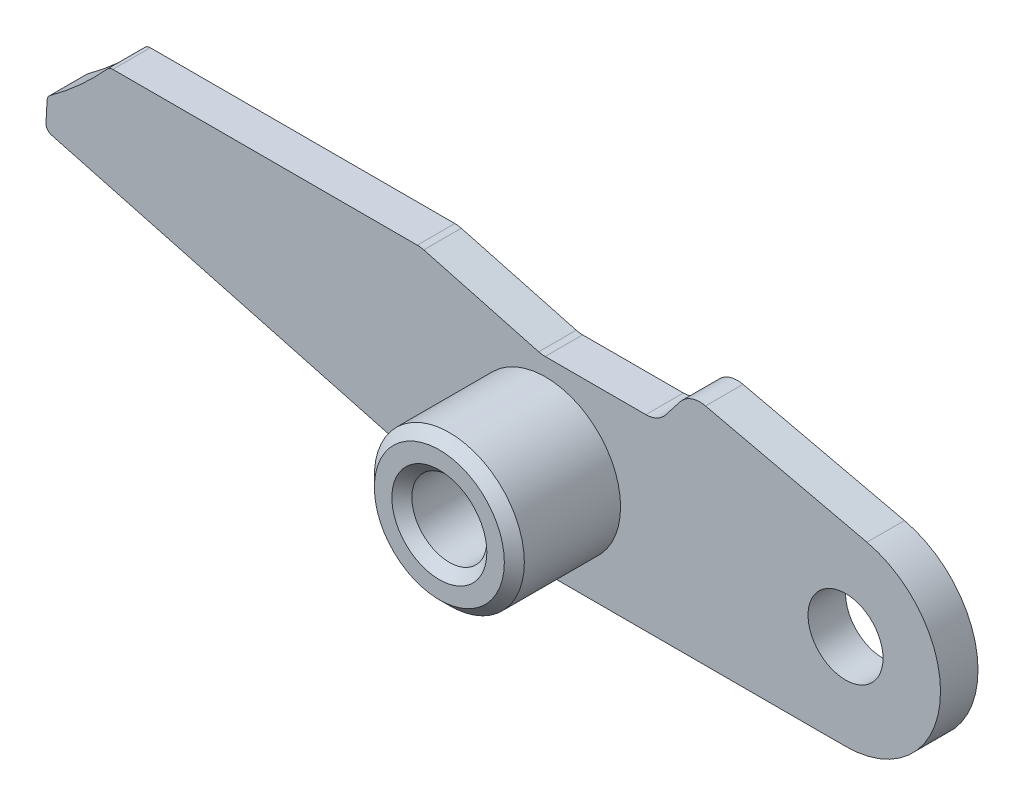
ISO-10303-21;
HEADER;
FILE_DESCRIPTION(('STEP AP214'),'2;1');
FILE_NAME('part.step','',(''),(''),'','','');
FILE_SCHEMA(('AUTOMOTIVE_DESIGN { 1 0 10303 214 1 1 1 1 }'));
ENDSEC;
DATA;
#1=APPLICATION_CONTEXT('core data for automotive mechanical design processes');
#2=APPLICATION_PROTOCOL_DEFINITION('international standard','automotive_design',2000,#1);
#3=PRODUCT_CONTEXT('',#1,'mechanical');
#4=PRODUCT('Part','Part','',(#3));
#5=PRODUCT_RELATED_PRODUCT_CATEGORY('part','',(#4));
#6=PRODUCT_DEFINITION_FORMATION('','',#4);
#7=PRODUCT_DEFINITION_CONTEXT('part definition',#1,'design');
#8=PRODUCT_DEFINITION('design','',#6,#7);
#9=PRODUCT_DEFINITION_SHAPE('','',#8);
#10=(LENGTH_UNIT() NAMED_UNIT(*) SI_UNIT(.MILLI.,.METRE.));
#11=(NAMED_UNIT(*) PLANE_ANGLE_UNIT() SI_UNIT($,.RADIAN.));
#12=(NAMED_UNIT(*) SI_UNIT($,.STERADIAN.) SOLID_ANGLE_UNIT());
#13=UNCERTAINTY_MEASURE_WITH_UNIT(LENGTH_MEASURE(1.E-05),#10,'distance_accuracy_value','');
#14=(GEOMETRIC_REPRESENTATION_CONTEXT(3) GLOBAL_UNCERTAINTY_ASSIGNED_CONTEXT((#13)) GLOBAL_UNIT_ASSIGNED_CONTEXT((#10,
#11,#12)) REPRESENTATION_CONTEXT('',''));
#15=CARTESIAN_POINT('',(0.,0.,0.));
#16=DIRECTION('',(0.,0.,1.));
#17=DIRECTION('',(1.,0.,0.));
#18=AXIS2_PLACEMENT_3D('',#15,#16,#17);
#19=CARTESIAN_POINT('',(-28.6659581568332,14.956057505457,-0.75));
#20=DIRECTION('',(0.,0.,1.));
#21=DIRECTION('',(1.,0.,0.));
#22=AXIS2_PLACEMENT_3D('',#19,#20,#21);
#23=PLANE('',#22);
#24=CARTESIAN_POINT('',(12.,0.,-0.75));
#25=DIRECTION('',(0.,0.,1.));
#26=DIRECTION('',(1.,0.,0.));
#27=AXIS2_PLACEMENT_3D('',#24,#25,#26);
#28=CIRCLE('',#27,1.5);
#29=CARTESIAN_POINT('',(13.5,0.,-0.75));
#30=VERTEX_POINT('',#29);
#31=EDGE_CURVE('E440',#30,#30,#28,.T.);
#32=ORIENTED_EDGE('',*,*,#31,.T.);
#33=EDGE_LOOP('',(#32));
#34=FACE_BOUND('',#33,.T.);
#35=DIRECTION('',(1.,0.,0.));
#36=VECTOR('',#35,1.);
#37=CARTESIAN_POINT('',(12.,-3.8,-0.75));
#38=LINE('',#37,#36);
#39=CARTESIAN_POINT('',(0.131652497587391,-3.8,-0.75));
#40=VERTEX_POINT('',#39);
#41=CARTESIAN_POINT('',(12.,-3.8,-0.75));
#42=VERTEX_POINT('',#41);
#43=EDGE_CURVE('E145',#40,#42,#38,.T.);
#44=ORIENTED_EDGE('',*,*,#43,.F.);
#45=CARTESIAN_POINT('',(0.131652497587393,-2.8,-0.75));
#46=DIRECTION('',(0.,0.,1.));
#47=DIRECTION('',(1.,0.,0.));
#48=AXIS2_PLACEMENT_3D('',#45,#46,#47);
#49=CIRCLE('',#48,1.);
#50=CARTESIAN_POINT('',(-0.127166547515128,-3.76592582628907,-0.75));
#51=VERTEX_POINT('',#50);
#52=EDGE_CURVE('E249',#40,#51,#49,.F.);
#53=ORIENTED_EDGE('',*,*,#52,.T.);
#54=DIRECTION('',(0.965925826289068,-0.258819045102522,0.));
#55=VECTOR('',#54,1.);
#56=CARTESIAN_POINT('',(0.,-3.8,-0.75));
#57=LINE('',#56,#55);
#58=CARTESIAN_POINT('',(-19.7653426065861,1.49610758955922,-0.75));
#59=VERTEX_POINT('',#58);
#60=EDGE_CURVE('E156',#59,#51,#57,.T.);
#61=ORIENTED_EDGE('',*,*,#60,.F.);
#62=CARTESIAN_POINT('',(-19.6876968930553,1.78588533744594,-0.75));
#63=DIRECTION('',(0.,0.,1.));
#64=DIRECTION('',(1.,0.,0.));
#65=AXIS2_PLACEMENT_3D('',#62,#63,#64);
#66=CIRCLE('',#65,0.3);
#67=CARTESIAN_POINT('',(-19.9872857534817,1.80158612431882,-0.75));
#68=VERTEX_POINT('',#67);
#69=EDGE_CURVE('E223',#59,#68,#66,.F.);
#70=ORIENTED_EDGE('',*,*,#69,.T.);
#71=DIRECTION('',(-0.0523359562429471,-0.998629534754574,0.));
#72=VECTOR('',#71,1.);
#73=CARTESIAN_POINT('',(-20.,1.55898384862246,-0.75));
#74=LINE('',#73,#72);
#75=CARTESIAN_POINT('',(-19.9447095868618,2.61398777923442,-0.75));
#76=VERTEX_POINT('',#75);
#77=EDGE_CURVE('E187',#76,#68,#74,.T.);
#78=ORIENTED_EDGE('',*,*,#77,.F.);
#79=CARTESIAN_POINT('',(-19.6451207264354,2.59828699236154,-0.75));
#80=DIRECTION('',(0.,0.,1.));
#81=DIRECTION('',(1.,0.,0.));
#82=AXIS2_PLACEMENT_3D('',#79,#80,#81);
#83=CIRCLE('',#82,0.3);
#84=CARTESIAN_POINT('',(-19.8219998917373,2.84059621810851,-0.75));
#85=VERTEX_POINT('',#84);
#86=EDGE_CURVE('E221',#76,#85,#83,.F.);
#87=ORIENTED_EDGE('',*,*,#86,.T.);
#88=CARTESIAN_POINT('',(-28.6659581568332,14.956057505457,-0.75));
#89=DIRECTION('',(0.,0.,-1.));
#90=DIRECTION('',(1.,0.,0.));
#91=AXIS2_PLACEMENT_3D('',#88,#89,#90);
#92=CIRCLE('',#91,15.);
#93=CARTESIAN_POINT('',(-17.5350187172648,4.90109916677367,-0.75));
#94=VERTEX_POINT('',#93);
#95=EDGE_CURVE('E184',#94,#85,#92,.T.);
#96=ORIENTED_EDGE('',*,*,#95,.F.);
#97=CARTESIAN_POINT('',(-17.3123999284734,4.7,-0.75));
#98=DIRECTION('',(0.,0.,1.));
#99=DIRECTION('',(1.,0.,0.));
#100=AXIS2_PLACEMENT_3D('',#97,#98,#99);
#101=CIRCLE('',#100,0.3);
#102=CARTESIAN_POINT('',(-17.3123999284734,5.,-0.75));
#103=VERTEX_POINT('',#102);
#104=EDGE_CURVE('E218',#94,#103,#101,.F.);
#105=ORIENTED_EDGE('',*,*,#104,.T.);
#106=DIRECTION('',(-1.,0.,0.));
#107=VECTOR('',#106,1.);
#108=CARTESIAN_POINT('',(-17.4464698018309,5.,-0.75));
#109=LINE('',#108,#107);
#110=CARTESIAN_POINT('',(-5.1316524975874,5.,-0.75));
#111=VERTEX_POINT('',#110);
#112=EDGE_CURVE('E182',#111,#103,#109,.T.);
#113=ORIENTED_EDGE('',*,*,#112,.F.);
#114=CARTESIAN_POINT('',(-5.1316524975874,4.,-0.75));
#115=DIRECTION('',(0.,0.,1.));
#116=DIRECTION('',(1.,0.,0.));
#117=AXIS2_PLACEMENT_3D('',#114,#115,#116);
#118=CIRCLE('',#117,1.);
#119=CARTESIAN_POINT('',(-4.87283345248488,4.96592582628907,-0.75));
#120=VERTEX_POINT('',#119);
#121=EDGE_CURVE('E245',#111,#120,#118,.F.);
#122=ORIENTED_EDGE('',*,*,#121,.T.);
#123=DIRECTION('',(-0.965925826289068,0.258819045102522,0.));
#124=VECTOR('',#123,1.);
#125=CARTESIAN_POINT('',(-5.,5.,-0.75));
#126=LINE('',#125,#124);
#127=CARTESIAN_POINT('',(-0.275500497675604,3.73407417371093,-0.75));
#128=VERTEX_POINT('',#127);
#129=EDGE_CURVE('E180',#128,#120,#126,.T.);
#130=ORIENTED_EDGE('',*,*,#129,.F.);
#131=CARTESIAN_POINT('',(-0.0166814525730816,4.7,-0.75));
#132=DIRECTION('',(0.,0.,1.));
#133=DIRECTION('',(1.,0.,0.));
#134=AXIS2_PLACEMENT_3D('',#131,#132,#133);
#135=CIRCLE('',#134,1.);
#136=CARTESIAN_POINT('',(-0.0166814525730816,3.7,-0.75));
#137=VERTEX_POINT('',#136);
#138=EDGE_CURVE('E281',#128,#137,#135,.T.);
#139=ORIENTED_EDGE('',*,*,#138,.T.);
#140=DIRECTION('',(-1.,0.,0.));
#141=VECTOR('',#140,1.);
#142=CARTESIAN_POINT('',(-0.148333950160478,3.7,-0.75));
#143=LINE('',#142,#141);
#144=CARTESIAN_POINT('',(4.01226741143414,3.7,-0.75));
#145=VERTEX_POINT('',#144);
#146=EDGE_CURVE('E177',#145,#137,#143,.T.);
#147=ORIENTED_EDGE('',*,*,#146,.F.);
#148=CARTESIAN_POINT('',(4.01226741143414,4.7,-0.75));
#149=DIRECTION('',(0.,0.,1.));
#150=DIRECTION('',(1.,0.,0.));
#151=AXIS2_PLACEMENT_3D('',#148,#149,#150);
#152=CIRCLE('',#151,1.);
#153=CARTESIAN_POINT('',(4.80027816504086,4.08433852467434,-0.75));
#154=VERTEX_POINT('',#153);
#155=EDGE_CURVE('E277',#145,#154,#152,.T.);
#156=ORIENTED_EDGE('',*,*,#155,.T.);
#157=DIRECTION('',(-0.615661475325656,-0.788010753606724,0.));
#158=VECTOR('',#157,1.);
#159=CARTESIAN_POINT('',(4.5,3.7,-0.75));
#160=LINE('',#159,#158);
#161=CARTESIAN_POINT('',(5.38621199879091,4.83429963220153,-0.75));
#162=VERTEX_POINT('',#161);
#163=EDGE_CURVE('E171',#162,#154,#160,.T.);
#164=ORIENTED_EDGE('',*,*,#163,.F.);
#165=CARTESIAN_POINT('',(6.17422275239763,4.21863815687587,-0.75));
#166=DIRECTION('',(0.,0.,1.));
#167=DIRECTION('',(1.,0.,0.));
#168=AXIS2_PLACEMENT_3D('',#165,#166,#167);
#169=CIRCLE('',#168,1.);
#170=CARTESIAN_POINT('',(6.39917380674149,5.19300822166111,-0.75));
#171=VERTEX_POINT('',#170);
#172=EDGE_CURVE('E247',#162,#171,#169,.F.);
#173=ORIENTED_EDGE('',*,*,#172,.T.);
#174=DIRECTION('',(-0.974370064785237,0.224951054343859,0.));
#175=VECTOR('',#174,1.);
#176=CARTESIAN_POINT('',(5.77843161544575,5.33631784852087,-0.75));
#177=LINE('',#176,#175);
#178=CARTESIAN_POINT('',(12.8548140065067,3.70260624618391,-0.75));
#179=VERTEX_POINT('',#178);
#180=EDGE_CURVE('E169',#179,#171,#177,.T.);
#181=ORIENTED_EDGE('',*,*,#180,.F.);
#182=CARTESIAN_POINT('',(12.,0.,-0.75));
#183=DIRECTION('',(0.,0.,1.));
#184=DIRECTION('',(1.,0.,0.));
#185=AXIS2_PLACEMENT_3D('',#182,#183,#184);
#186=CIRCLE('',#185,3.8);
#187=EDGE_CURVE('E155',#42,#179,#186,.T.);
#188=ORIENTED_EDGE('',*,*,#187,.F.);
#189=EDGE_LOOP('',(#44,#53,#61,#70,#78,#87,#96,#105,#113,#122,#130,#139,#147,#156,#164,#173,
#181,#188));
#190=FACE_BOUND('',#189,.T.);
#191=CARTESIAN_POINT('',(0.,0.,-0.75));
#192=DIRECTION('',(0.,0.,1.));
#193=DIRECTION('',(1.,0.,0.));
#194=AXIS2_PLACEMENT_3D('',#191,#192,#193);
#195=CIRCLE('',#194,2.75);
#196=CARTESIAN_POINT('',(2.75,0.,-0.75));
#197=VERTEX_POINT('',#196);
#198=EDGE_CURVE('E297',#197,#197,#195,.F.);
#199=ORIENTED_EDGE('',*,*,#198,.F.);
#200=EDGE_LOOP('',(#199));
#201=FACE_BOUND('',#200,.T.);
#202=ADVANCED_FACE('F17',(#34,#190,#201),#23,.F.);
#203=CARTESIAN_POINT('',(-28.6659581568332,14.956057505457,0.75));
#204=DIRECTION('',(0.,0.,1.));
#205=DIRECTION('',(1.,0.,0.));
#206=AXIS2_PLACEMENT_3D('',#203,#204,#205);
#207=PLANE('',#206);
#208=CARTESIAN_POINT('',(12.,0.,0.75));
#209=DIRECTION('',(0.,0.,1.));
#210=DIRECTION('',(1.,0.,0.));
#211=AXIS2_PLACEMENT_3D('',#208,#209,#210);
#212=CIRCLE('',#211,1.5);
#213=CARTESIAN_POINT('',(13.5,0.,0.75));
#214=VERTEX_POINT('',#213);
#215=EDGE_CURVE('E372',#214,#214,#212,.T.);
#216=ORIENTED_EDGE('',*,*,#215,.F.);
#217=EDGE_LOOP('',(#216));
#218=FACE_BOUND('',#217,.T.);
#219=DIRECTION('',(0.965925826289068,-0.258819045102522,0.));
#220=VECTOR('',#219,1.);
#221=CARTESIAN_POINT('',(0.,-3.8,0.75));
#222=LINE('',#221,#220);
#223=CARTESIAN_POINT('',(-19.7653426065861,1.49610758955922,0.75));
#224=VERTEX_POINT('',#223);
#225=CARTESIAN_POINT('',(-0.127166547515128,-3.76592582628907,0.75));
#226=VERTEX_POINT('',#225);
#227=EDGE_CURVE('E190',#224,#226,#222,.T.);
#228=ORIENTED_EDGE('',*,*,#227,.T.);
#229=CARTESIAN_POINT('',(0.131652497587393,-2.8,0.75));
#230=DIRECTION('',(0.,0.,1.));
#231=DIRECTION('',(1.,0.,0.));
#232=AXIS2_PLACEMENT_3D('',#229,#230,#231);
#233=CIRCLE('',#232,1.);
#234=CARTESIAN_POINT('',(0.131652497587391,-3.8,0.75));
#235=VERTEX_POINT('',#234);
#236=EDGE_CURVE('E256',#226,#235,#233,.T.);
#237=ORIENTED_EDGE('',*,*,#236,.T.);
#238=DIRECTION('',(1.,0.,0.));
#239=VECTOR('',#238,1.);
#240=CARTESIAN_POINT('',(12.,-3.8,0.75));
#241=LINE('',#240,#239);
#242=CARTESIAN_POINT('',(12.,-3.8,0.75));
#243=VERTEX_POINT('',#242);
#244=EDGE_CURVE('E193',#235,#243,#241,.T.);
#245=ORIENTED_EDGE('',*,*,#244,.T.);
#246=CARTESIAN_POINT('',(12.,0.,0.75));
#247=DIRECTION('',(0.,0.,1.));
#248=DIRECTION('',(1.,0.,0.));
#249=AXIS2_PLACEMENT_3D('',#246,#247,#248);
#250=CIRCLE('',#249,3.8);
#251=CARTESIAN_POINT('',(12.8548140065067,3.70260624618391,0.75));
#252=VERTEX_POINT('',#251);
#253=EDGE_CURVE('E162',#243,#252,#250,.T.);
#254=ORIENTED_EDGE('',*,*,#253,.T.);
#255=DIRECTION('',(-0.974370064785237,0.224951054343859,0.));
#256=VECTOR('',#255,1.);
#257=CARTESIAN_POINT('',(5.77843161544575,5.33631784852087,0.75));
#258=LINE('',#257,#256);
#259=CARTESIAN_POINT('',(6.39917380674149,5.19300822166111,0.75));
#260=VERTEX_POINT('',#259);
#261=EDGE_CURVE('E196',#252,#260,#258,.T.);
#262=ORIENTED_EDGE('',*,*,#261,.T.);
#263=CARTESIAN_POINT('',(6.17422275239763,4.21863815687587,0.75));
#264=DIRECTION('',(0.,0.,1.));
#265=DIRECTION('',(1.,0.,0.));
#266=AXIS2_PLACEMENT_3D('',#263,#264,#265);
#267=CIRCLE('',#266,1.);
#268=CARTESIAN_POINT('',(5.38621199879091,4.83429963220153,0.75));
#269=VERTEX_POINT('',#268);
#270=EDGE_CURVE('E254',#260,#269,#267,.T.);
#271=ORIENTED_EDGE('',*,*,#270,.T.);
#272=DIRECTION('',(-0.615661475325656,-0.788010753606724,0.));
#273=VECTOR('',#272,1.);
#274=CARTESIAN_POINT('',(4.5,3.7,0.75));
#275=LINE('',#274,#273);
#276=CARTESIAN_POINT('',(4.80027816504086,4.08433852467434,0.75));
#277=VERTEX_POINT('',#276);
#278=EDGE_CURVE('E199',#269,#277,#275,.T.);
#279=ORIENTED_EDGE('',*,*,#278,.T.);
#280=CARTESIAN_POINT('',(4.01226741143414,4.7,0.75));
#281=DIRECTION('',(0.,0.,1.));
#282=DIRECTION('',(1.,0.,0.));
#283=AXIS2_PLACEMENT_3D('',#280,#281,#282);
#284=CIRCLE('',#283,1.);
#285=CARTESIAN_POINT('',(4.01226741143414,3.7,0.75));
#286=VERTEX_POINT('',#285);
#287=EDGE_CURVE('E279',#277,#286,#284,.F.);
#288=ORIENTED_EDGE('',*,*,#287,.T.);
#289=DIRECTION('',(-1.,0.,0.));
#290=VECTOR('',#289,1.);
#291=CARTESIAN_POINT('',(-0.148333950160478,3.7,0.75));
#292=LINE('',#291,#290);
#293=CARTESIAN_POINT('',(-0.0166814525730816,3.7,0.75));
#294=VERTEX_POINT('',#293);
#295=EDGE_CURVE('E202',#286,#294,#292,.T.);
#296=ORIENTED_EDGE('',*,*,#295,.T.);
#297=CARTESIAN_POINT('',(-0.0166814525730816,4.7,0.75));
#298=DIRECTION('',(0.,0.,1.));
#299=DIRECTION('',(1.,0.,0.));
#300=AXIS2_PLACEMENT_3D('',#297,#298,#299);
#301=CIRCLE('',#300,1.);
#302=CARTESIAN_POINT('',(-0.275500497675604,3.73407417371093,0.75));
#303=VERTEX_POINT('',#302);
#304=EDGE_CURVE('E283',#294,#303,#301,.F.);
#305=ORIENTED_EDGE('',*,*,#304,.T.);
#306=DIRECTION('',(-0.965925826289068,0.258819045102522,0.));
#307=VECTOR('',#306,1.);
#308=CARTESIAN_POINT('',(-5.,5.,0.75));
#309=LINE('',#308,#307);
#310=CARTESIAN_POINT('',(-4.87283345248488,4.96592582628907,0.75));
#311=VERTEX_POINT('',#310);
#312=EDGE_CURVE('E205',#303,#311,#309,.T.);
#313=ORIENTED_EDGE('',*,*,#312,.T.);
#314=CARTESIAN_POINT('',(-5.1316524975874,4.,0.75));
#315=DIRECTION('',(0.,0.,1.));
#316=DIRECTION('',(1.,0.,0.));
#317=AXIS2_PLACEMENT_3D('',#314,#315,#316);
#318=CIRCLE('',#317,1.);
#319=CARTESIAN_POINT('',(-5.1316524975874,5.,0.75));
#320=VERTEX_POINT('',#319);
#321=EDGE_CURVE('E32',#311,#320,#318,.T.);
#322=ORIENTED_EDGE('',*,*,#321,.T.);
#323=DIRECTION('',(-1.,0.,0.));
#324=VECTOR('',#323,1.);
#325=CARTESIAN_POINT('',(-17.4464698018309,5.,0.75));
#326=LINE('',#325,#324);
#327=CARTESIAN_POINT('',(-17.3123999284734,5.,0.75));
#328=VERTEX_POINT('',#327);
#329=EDGE_CURVE('E207',#320,#328,#326,.T.);
#330=ORIENTED_EDGE('',*,*,#329,.T.);
#331=CARTESIAN_POINT('',(-17.3123999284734,4.7,0.75));
#332=DIRECTION('',(0.,0.,1.));
#333=DIRECTION('',(1.,0.,0.));
#334=AXIS2_PLACEMENT_3D('',#331,#332,#333);
#335=CIRCLE('',#334,0.3);
#336=CARTESIAN_POINT('',(-17.5350187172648,4.90109916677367,0.75));
#337=VERTEX_POINT('',#336);
#338=EDGE_CURVE('E230',#328,#337,#335,.T.);
#339=ORIENTED_EDGE('',*,*,#338,.T.);
#340=CARTESIAN_POINT('',(-28.6659581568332,14.956057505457,0.75));
#341=DIRECTION('',(0.,0.,-1.));
#342=DIRECTION('',(1.,0.,0.));
#343=AXIS2_PLACEMENT_3D('',#340,#341,#342);
#344=CIRCLE('',#343,15.);
#345=CARTESIAN_POINT('',(-19.8219998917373,2.84059621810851,0.75));
#346=VERTEX_POINT('',#345);
#347=EDGE_CURVE('E209',#337,#346,#344,.T.);
#348=ORIENTED_EDGE('',*,*,#347,.T.);
#349=CARTESIAN_POINT('',(-19.6451207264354,2.59828699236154,0.75));
#350=DIRECTION('',(0.,0.,1.));
#351=DIRECTION('',(1.,0.,0.));
#352=AXIS2_PLACEMENT_3D('',#349,#350,#351);
#353=CIRCLE('',#352,0.3);
#354=CARTESIAN_POINT('',(-19.9447095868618,2.61398777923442,0.75));
#355=VERTEX_POINT('',#354);
#356=EDGE_CURVE('E232',#346,#355,#353,.T.);
#357=ORIENTED_EDGE('',*,*,#356,.T.);
#358=DIRECTION('',(-0.0523359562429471,-0.998629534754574,0.));
#359=VECTOR('',#358,1.);
#360=CARTESIAN_POINT('',(-20.,1.55898384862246,0.75));
#361=LINE('',#360,#359);
#362=CARTESIAN_POINT('',(-19.9872857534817,1.80158612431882,0.75));
#363=VERTEX_POINT('',#362);
#364=EDGE_CURVE('E212',#355,#363,#361,.T.);
#365=ORIENTED_EDGE('',*,*,#364,.T.);
#366=CARTESIAN_POINT('',(-19.6876968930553,1.78588533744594,0.75));
#367=DIRECTION('',(0.,0.,1.));
#368=DIRECTION('',(1.,0.,0.));
#369=AXIS2_PLACEMENT_3D('',#366,#367,#368);
#370=CIRCLE('',#369,0.3);
#371=EDGE_CURVE('E234',#363,#224,#370,.T.);
#372=ORIENTED_EDGE('',*,*,#371,.T.);
#373=EDGE_LOOP('',(#228,#237,#245,#254,#262,#271,#279,#288,#296,#305,#313,#322,#330,#339,#348,
#357,#365,#372));
#374=FACE_BOUND('',#373,.T.);
#375=CARTESIAN_POINT('',(0.,0.,0.75));
#376=DIRECTION('',(0.,0.,1.));
#377=DIRECTION('',(1.,0.,0.));
#378=AXIS2_PLACEMENT_3D('',#375,#376,#377);
#379=CIRCLE('',#378,3.);
#380=CARTESIAN_POINT('',(3.,0.,0.75));
#381=VERTEX_POINT('',#380);
#382=EDGE_CURVE('E441',#381,#381,#379,.T.);
#383=ORIENTED_EDGE('',*,*,#382,.F.);
#384=EDGE_LOOP('',(#383));
#385=FACE_BOUND('',#384,.T.);
#386=ADVANCED_FACE('F320',(#218,#374,#385),#207,.T.);
#387=CARTESIAN_POINT('',(0.,-3.8,0.75));
#388=DIRECTION('',(0.258819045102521,0.965925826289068,0.));
#389=DIRECTION('',(-0.965925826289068,0.258819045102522,0.));
#390=AXIS2_PLACEMENT_3D('',#387,#388,#389);
#391=PLANE('',#390);
#392=ORIENTED_EDGE('',*,*,#60,.T.);
#393=DIRECTION('',(0.,0.,-1.));
#394=VECTOR('',#393,1.);
#395=CARTESIAN_POINT('',(-0.127166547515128,-3.76592582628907,0.75));
#396=LINE('',#395,#394);
#397=EDGE_CURVE('E251',#51,#226,#396,.F.);
#398=ORIENTED_EDGE('',*,*,#397,.T.);
#399=ORIENTED_EDGE('',*,*,#227,.F.);
#400=DIRECTION('',(0.,0.,-1.));
#401=VECTOR('',#400,1.);
#402=CARTESIAN_POINT('',(-19.7653426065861,1.49610758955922,0.75));
#403=LINE('',#402,#401);
#404=EDGE_CURVE('E163',#224,#59,#403,.T.);
#405=ORIENTED_EDGE('',*,*,#404,.T.);
#406=EDGE_LOOP('',(#392,#398,#399,#405));
#407=FACE_BOUND('',#406,.T.);
#408=ADVANCED_FACE('F19',(#407),#391,.F.);
#409=CARTESIAN_POINT('',(12.,-3.8,0.75));
#410=DIRECTION('',(0.,1.,0.));
#411=DIRECTION('',(-1.,0.,0.));
#412=AXIS2_PLACEMENT_3D('',#409,#410,#411);
#413=PLANE('',#412);
#414=ORIENTED_EDGE('',*,*,#244,.F.);
#415=DIRECTION('',(0.,0.,-1.));
#416=VECTOR('',#415,1.);
#417=CARTESIAN_POINT('',(0.131652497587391,-3.8,0.75));
#418=LINE('',#417,#416);
#419=EDGE_CURVE('E152',#235,#40,#418,.T.);
#420=ORIENTED_EDGE('',*,*,#419,.T.);
#421=ORIENTED_EDGE('',*,*,#43,.T.);
#422=DIRECTION('',(0.,0.,-1.));
#423=VECTOR('',#422,1.);
#424=CARTESIAN_POINT('',(12.,-3.8,0.75));
#425=LINE('',#424,#423);
#426=EDGE_CURVE('E149',#243,#42,#425,.T.);
#427=ORIENTED_EDGE('',*,*,#426,.F.);
#428=EDGE_LOOP('',(#414,#420,#421,#427));
#429=FACE_BOUND('',#428,.T.);
#430=ADVANCED_FACE('F148',(#429),#413,.F.);
#431=CARTESIAN_POINT('',(12.,0.,0.75));
#432=DIRECTION('',(0.,0.,-1.));
#433=DIRECTION('',(-1.,0.,0.));
#434=AXIS2_PLACEMENT_3D('',#431,#432,#433);
#435=CYLINDRICAL_SURFACE('',#434,3.8);
#436=ORIENTED_EDGE('',*,*,#187,.T.);
#437=DIRECTION('',(0.,0.,-1.));
#438=VECTOR('',#437,1.);
#439=CARTESIAN_POINT('',(12.8548140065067,3.70260624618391,0.75));
#440=LINE('',#439,#438);
#441=EDGE_CURVE('E164',#252,#179,#440,.T.);
#442=ORIENTED_EDGE('',*,*,#441,.F.);
#443=ORIENTED_EDGE('',*,*,#253,.F.);
#444=ORIENTED_EDGE('',*,*,#426,.T.);
#445=EDGE_LOOP('',(#436,#442,#443,#444));
#446=FACE_BOUND('',#445,.T.);
#447=ADVANCED_FACE('F159',(#446),#435,.T.);
#448=CARTESIAN_POINT('',(5.77843161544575,5.33631784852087,0.75));
#449=DIRECTION('',(-0.224951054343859,-0.974370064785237,0.));
#450=DIRECTION('',(0.974370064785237,-0.224951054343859,0.));
#451=AXIS2_PLACEMENT_3D('',#448,#449,#450);
#452=PLANE('',#451);
#453=ORIENTED_EDGE('',*,*,#180,.T.);
#454=DIRECTION('',(0.,0.,-1.));
#455=VECTOR('',#454,1.);
#456=CARTESIAN_POINT('',(6.39917380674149,5.19300822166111,0.75));
#457=LINE('',#456,#455);
#458=EDGE_CURVE('E263',#171,#260,#457,.F.);
#459=ORIENTED_EDGE('',*,*,#458,.T.);
#460=ORIENTED_EDGE('',*,*,#261,.F.);
#461=ORIENTED_EDGE('',*,*,#441,.T.);
#462=EDGE_LOOP('',(#453,#459,#460,#461));
#463=FACE_BOUND('',#462,.T.);
#464=ADVANCED_FACE('F354',(#463),#452,.F.);
#465=CARTESIAN_POINT('',(4.5,3.7,0.75));
#466=DIRECTION('',(0.788010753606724,-0.615661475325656,0.));
#467=DIRECTION('',(0.615661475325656,0.788010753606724,0.));
#468=AXIS2_PLACEMENT_3D('',#465,#466,#467);
#469=PLANE('',#468);
#470=ORIENTED_EDGE('',*,*,#278,.F.);
#471=DIRECTION('',(0.,0.,-1.));
#472=VECTOR('',#471,1.);
#473=CARTESIAN_POINT('',(5.38621199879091,4.83429963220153,0.75));
#474=LINE('',#473,#472);
#475=EDGE_CURVE('E260',#269,#162,#474,.T.);
#476=ORIENTED_EDGE('',*,*,#475,.T.);
#477=ORIENTED_EDGE('',*,*,#163,.T.);
#478=DIRECTION('',(0.,0.,-1.));
#479=VECTOR('',#478,1.);
#480=CARTESIAN_POINT('',(4.80027816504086,4.08433852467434,0.75));
#481=LINE('',#480,#479);
#482=EDGE_CURVE('E258',#154,#277,#481,.F.);
#483=ORIENTED_EDGE('',*,*,#482,.T.);
#484=EDGE_LOOP('',(#470,#476,#477,#483));
#485=FACE_BOUND('',#484,.T.);
#486=ADVANCED_FACE('F350',(#485),#469,.F.);
#487=CARTESIAN_POINT('',(-0.148333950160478,3.7,0.75));
#488=DIRECTION('',(0.,-1.,0.));
#489=DIRECTION('',(0.,0.,-1.));
#490=AXIS2_PLACEMENT_3D('',#487,#488,#489);
#491=PLANE('',#490);
#492=ORIENTED_EDGE('',*,*,#295,.F.);
#493=DIRECTION('',(0.,0.,-1.));
#494=VECTOR('',#493,1.);
#495=CARTESIAN_POINT('',(4.01226741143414,3.7,-0.75));
#496=LINE('',#495,#494);
#497=EDGE_CURVE('E267',#286,#145,#496,.T.);
#498=ORIENTED_EDGE('',*,*,#497,.T.);
#499=ORIENTED_EDGE('',*,*,#146,.T.);
#500=DIRECTION('',(0.,0.,-1.));
#501=VECTOR('',#500,1.);
#502=CARTESIAN_POINT('',(-0.0166814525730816,3.7,0.75));
#503=LINE('',#502,#501);
#504=EDGE_CURVE('E265',#137,#294,#503,.F.);
#505=ORIENTED_EDGE('',*,*,#504,.T.);
#506=EDGE_LOOP('',(#492,#498,#499,#505));
#507=FACE_BOUND('',#506,.T.);
#508=ADVANCED_FACE('F347',(#507),#491,.F.);
#509=CARTESIAN_POINT('',(-5.,5.,0.75));
#510=DIRECTION('',(-0.258819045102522,-0.965925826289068,0.));
#511=DIRECTION('',(0.965925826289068,-0.258819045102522,0.));
#512=AXIS2_PLACEMENT_3D('',#509,#510,#511);
#513=PLANE('',#512);
#514=ORIENTED_EDGE('',*,*,#312,.F.);
#515=DIRECTION('',(0.,0.,-1.));
#516=VECTOR('',#515,1.);
#517=CARTESIAN_POINT('',(-0.275500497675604,3.73407417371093,-0.75));
#518=LINE('',#517,#516);
#519=EDGE_CURVE('E271',#303,#128,#518,.T.);
#520=ORIENTED_EDGE('',*,*,#519,.T.);
#521=ORIENTED_EDGE('',*,*,#129,.T.);
#522=DIRECTION('',(0.,0.,-1.));
#523=VECTOR('',#522,1.);
#524=CARTESIAN_POINT('',(-4.87283345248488,4.96592582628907,0.75));
#525=LINE('',#524,#523);
#526=EDGE_CURVE('E40',#120,#311,#525,.F.);
#527=ORIENTED_EDGE('',*,*,#526,.T.);
#528=EDGE_LOOP('',(#514,#520,#521,#527));
#529=FACE_BOUND('',#528,.T.);
#530=ADVANCED_FACE('F343',(#529),#513,.F.);
#531=CARTESIAN_POINT('',(-17.4464698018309,5.,0.75));
#532=DIRECTION('',(0.,-1.,0.));
#533=DIRECTION('',(1.,0.,0.));
#534=AXIS2_PLACEMENT_3D('',#531,#532,#533);
#535=PLANE('',#534);
#536=ORIENTED_EDGE('',*,*,#329,.F.);
#537=DIRECTION('',(0.,0.,-1.));
#538=VECTOR('',#537,1.);
#539=CARTESIAN_POINT('',(-5.1316524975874,5.,0.75));
#540=LINE('',#539,#538);
#541=EDGE_CURVE('E274',#320,#111,#540,.T.);
#542=ORIENTED_EDGE('',*,*,#541,.T.);
#543=ORIENTED_EDGE('',*,*,#112,.T.);
#544=DIRECTION('',(0.,0.,-1.));
#545=VECTOR('',#544,1.);
#546=CARTESIAN_POINT('',(-17.3123999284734,5.,0.75));
#547=LINE('',#546,#545);
#548=EDGE_CURVE('E241',#103,#328,#547,.F.);
#549=ORIENTED_EDGE('',*,*,#548,.T.);
#550=EDGE_LOOP('',(#536,#542,#543,#549));
#551=FACE_BOUND('',#550,.T.);
#552=ADVANCED_FACE('F339',(#551),#535,.F.);
#553=CARTESIAN_POINT('',(-28.6659581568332,14.956057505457,0.75));
#554=DIRECTION('',(0.,0.,-1.));
#555=DIRECTION('',(-1.,0.,0.));
#556=AXIS2_PLACEMENT_3D('',#553,#554,#555);
#557=CYLINDRICAL_SURFACE('',#556,15.);
#558=ORIENTED_EDGE('',*,*,#95,.T.);
#559=DIRECTION('',(0.,0.,-1.));
#560=VECTOR('',#559,1.);
#561=CARTESIAN_POINT('',(-19.8219998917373,2.84059621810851,0.75));
#562=LINE('',#561,#560);
#563=EDGE_CURVE('E239',#85,#346,#562,.F.);
#564=ORIENTED_EDGE('',*,*,#563,.T.);
#565=ORIENTED_EDGE('',*,*,#347,.F.);
#566=DIRECTION('',(0.,0.,-1.));
#567=VECTOR('',#566,1.);
#568=CARTESIAN_POINT('',(-17.5350187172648,4.90109916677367,0.75));
#569=LINE('',#568,#567);
#570=EDGE_CURVE('E236',#337,#94,#569,.T.);
#571=ORIENTED_EDGE('',*,*,#570,.T.);
#572=EDGE_LOOP('',(#558,#564,#565,#571));
#573=FACE_BOUND('',#572,.T.);
#574=ADVANCED_FACE('F335',(#573),#557,.F.);
#575=CARTESIAN_POINT('',(-20.,1.55898384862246,0.75));
#576=DIRECTION('',(0.998629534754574,-0.0523359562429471,0.));
#577=DIRECTION('',(0.0523359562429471,0.998629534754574,0.));
#578=AXIS2_PLACEMENT_3D('',#575,#576,#577);
#579=PLANE('',#578);
#580=ORIENTED_EDGE('',*,*,#77,.T.);
#581=DIRECTION('',(0.,0.,-1.));
#582=VECTOR('',#581,1.);
#583=CARTESIAN_POINT('',(-19.9872857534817,1.80158612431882,0.75));
#584=LINE('',#583,#582);
#585=EDGE_CURVE('E228',#68,#363,#584,.F.);
#586=ORIENTED_EDGE('',*,*,#585,.T.);
#587=ORIENTED_EDGE('',*,*,#364,.F.);
#588=DIRECTION('',(0.,0.,-1.));
#589=VECTOR('',#588,1.);
#590=CARTESIAN_POINT('',(-19.9447095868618,2.61398777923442,0.75));
#591=LINE('',#590,#589);
#592=EDGE_CURVE('E225',#355,#76,#591,.T.);
#593=ORIENTED_EDGE('',*,*,#592,.T.);
#594=EDGE_LOOP('',(#580,#586,#587,#593));
#595=FACE_BOUND('',#594,.T.);
#596=ADVANCED_FACE('F332',(#595),#579,.F.);
#597=CARTESIAN_POINT('',(0.,0.,0.75));
#598=DIRECTION('',(0.,0.,-1.));
#599=DIRECTION('',(-1.,0.,0.));
#600=AXIS2_PLACEMENT_3D('',#597,#598,#599);
#601=CYLINDRICAL_SURFACE('',#600,1.5);
#602=CARTESIAN_POINT('',(0.,0.,-0.85));
#603=DIRECTION('',(0.,0.,-1.));
#604=DIRECTION('',(-1.,0.,0.));
#605=AXIS2_PLACEMENT_3D('',#602,#603,#604);
#606=CIRCLE('',#605,1.5);
#607=CARTESIAN_POINT('',(-1.5,0.,-0.85));
#608=VERTEX_POINT('',#607);
#609=EDGE_CURVE('E25',#608,#608,#606,.T.);
#610=ORIENTED_EDGE('',*,*,#609,.T.);
#611=EDGE_LOOP('',(#610));
#612=FACE_BOUND('',#611,.T.);
#613=CARTESIAN_POINT('',(0.,0.,4.6));
#614=DIRECTION('',(0.,0.,1.));
#615=DIRECTION('',(1.,0.,0.));
#616=AXIS2_PLACEMENT_3D('',#613,#614,#615);
#617=CIRCLE('',#616,1.5);
#618=CARTESIAN_POINT('',(1.5,0.,4.6));
#619=VERTEX_POINT('',#618);
#620=EDGE_CURVE('E285',#619,#619,#617,.T.);
#621=ORIENTED_EDGE('',*,*,#620,.T.);
#622=EDGE_LOOP('',(#621));
#623=FACE_BOUND('',#622,.T.);
#624=ADVANCED_FACE('F302',(#612,#623),#601,.F.);
#625=CARTESIAN_POINT('',(12.,0.,0.75));
#626=DIRECTION('',(0.,0.,-1.));
#627=DIRECTION('',(-1.,0.,0.));
#628=AXIS2_PLACEMENT_3D('',#625,#626,#627);
#629=CYLINDRICAL_SURFACE('',#628,1.5);
#630=ORIENTED_EDGE('',*,*,#215,.T.);
#631=EDGE_LOOP('',(#630));
#632=FACE_BOUND('',#631,.T.);
#633=ORIENTED_EDGE('',*,*,#31,.F.);
#634=EDGE_LOOP('',(#633));
#635=FACE_BOUND('',#634,.T.);
#636=ADVANCED_FACE('F430',(#632,#635),#629,.F.);
#637=CARTESIAN_POINT('',(-19.6876968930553,1.78588533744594,0.75));
#638=DIRECTION('',(0.,0.,-1.));
#639=DIRECTION('',(-1.,0.,0.));
#640=AXIS2_PLACEMENT_3D('',#637,#638,#639);
#641=CYLINDRICAL_SURFACE('',#640,0.3);
#642=ORIENTED_EDGE('',*,*,#371,.F.);
#643=ORIENTED_EDGE('',*,*,#585,.F.);
#644=ORIENTED_EDGE('',*,*,#69,.F.);
#645=ORIENTED_EDGE('',*,*,#404,.F.);
#646=EDGE_LOOP('',(#642,#643,#644,#645));
#647=FACE_BOUND('',#646,.T.);
#648=ADVANCED_FACE('F379',(#647),#641,.T.);
#649=CARTESIAN_POINT('',(-19.6451207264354,2.59828699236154,0.75));
#650=DIRECTION('',(0.,0.,-1.));
#651=DIRECTION('',(-1.,0.,0.));
#652=AXIS2_PLACEMENT_3D('',#649,#650,#651);
#653=CYLINDRICAL_SURFACE('',#652,0.3);
#654=ORIENTED_EDGE('',*,*,#356,.F.);
#655=ORIENTED_EDGE('',*,*,#563,.F.);
#656=ORIENTED_EDGE('',*,*,#86,.F.);
#657=ORIENTED_EDGE('',*,*,#592,.F.);
#658=EDGE_LOOP('',(#654,#655,#656,#657));
#659=FACE_BOUND('',#658,.T.);
#660=ADVANCED_FACE('F386',(#659),#653,.T.);
#661=CARTESIAN_POINT('',(-17.3123999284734,4.7,0.75));
#662=DIRECTION('',(0.,0.,-1.));
#663=DIRECTION('',(-1.,0.,0.));
#664=AXIS2_PLACEMENT_3D('',#661,#662,#663);
#665=CYLINDRICAL_SURFACE('',#664,0.3);
#666=ORIENTED_EDGE('',*,*,#338,.F.);
#667=ORIENTED_EDGE('',*,*,#548,.F.);
#668=ORIENTED_EDGE('',*,*,#104,.F.);
#669=ORIENTED_EDGE('',*,*,#570,.F.);
#670=EDGE_LOOP('',(#666,#667,#668,#669));
#671=FACE_BOUND('',#670,.T.);
#672=ADVANCED_FACE('F393',(#671),#665,.T.);
#673=CARTESIAN_POINT('',(0.131652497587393,-2.8,0.75));
#674=DIRECTION('',(0.,0.,-1.));
#675=DIRECTION('',(-1.,0.,0.));
#676=AXIS2_PLACEMENT_3D('',#673,#674,#675);
#677=CYLINDRICAL_SURFACE('',#676,1.);
#678=ORIENTED_EDGE('',*,*,#236,.F.);
#679=ORIENTED_EDGE('',*,*,#397,.F.);
#680=ORIENTED_EDGE('',*,*,#52,.F.);
#681=ORIENTED_EDGE('',*,*,#419,.F.);
#682=EDGE_LOOP('',(#678,#679,#680,#681));
#683=FACE_BOUND('',#682,.T.);
#684=ADVANCED_FACE('F375',(#683),#677,.T.);
#685=CARTESIAN_POINT('',(6.17422275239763,4.21863815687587,0.75));
#686=DIRECTION('',(0.,0.,-1.));
#687=DIRECTION('',(-1.,0.,0.));
#688=AXIS2_PLACEMENT_3D('',#685,#686,#687);
#689=CYLINDRICAL_SURFACE('',#688,1.);
#690=ORIENTED_EDGE('',*,*,#270,.F.);
#691=ORIENTED_EDGE('',*,*,#458,.F.);
#692=ORIENTED_EDGE('',*,*,#172,.F.);
#693=ORIENTED_EDGE('',*,*,#475,.F.);
#694=EDGE_LOOP('',(#690,#691,#692,#693));
#695=FACE_BOUND('',#694,.T.);
#696=ADVANCED_FACE('F418',(#695),#689,.T.);
#697=CARTESIAN_POINT('',(4.01226741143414,4.7,0.75));
#698=DIRECTION('',(0.,0.,1.));
#699=DIRECTION('',(1.,0.,0.));
#700=AXIS2_PLACEMENT_3D('',#697,#698,#699);
#701=CYLINDRICAL_SURFACE('',#700,1.);
#702=ORIENTED_EDGE('',*,*,#287,.F.);
#703=ORIENTED_EDGE('',*,*,#482,.F.);
#704=ORIENTED_EDGE('',*,*,#155,.F.);
#705=ORIENTED_EDGE('',*,*,#497,.F.);
#706=EDGE_LOOP('',(#702,#703,#704,#705));
#707=FACE_BOUND('',#706,.T.);
#708=ADVANCED_FACE('F411',(#707),#701,.F.);
#709=CARTESIAN_POINT('',(-0.0166814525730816,4.7,0.75));
#710=DIRECTION('',(0.,0.,1.));
#711=DIRECTION('',(1.,0.,0.));
#712=AXIS2_PLACEMENT_3D('',#709,#710,#711);
#713=CYLINDRICAL_SURFACE('',#712,1.);
#714=ORIENTED_EDGE('',*,*,#304,.F.);
#715=ORIENTED_EDGE('',*,*,#504,.F.);
#716=ORIENTED_EDGE('',*,*,#138,.F.);
#717=ORIENTED_EDGE('',*,*,#519,.F.);
#718=EDGE_LOOP('',(#714,#715,#716,#717));
#719=FACE_BOUND('',#718,.T.);
#720=ADVANCED_FACE('F402',(#719),#713,.F.);
#721=CARTESIAN_POINT('',(-5.1316524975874,4.,0.75));
#722=DIRECTION('',(0.,0.,-1.));
#723=DIRECTION('',(-1.,0.,0.));
#724=AXIS2_PLACEMENT_3D('',#721,#722,#723);
#725=CYLINDRICAL_SURFACE('',#724,1.);
#726=ORIENTED_EDGE('',*,*,#321,.F.);
#727=ORIENTED_EDGE('',*,*,#526,.F.);
#728=ORIENTED_EDGE('',*,*,#121,.F.);
#729=ORIENTED_EDGE('',*,*,#541,.F.);
#730=EDGE_LOOP('',(#726,#727,#728,#729));
#731=FACE_BOUND('',#730,.T.);
#732=ADVANCED_FACE('F399',(#731),#725,.T.);
#733=CARTESIAN_POINT('',(0.,0.,5.));
#734=DIRECTION('',(0.,0.,1.));
#735=DIRECTION('',(1.,0.,0.));
#736=AXIS2_PLACEMENT_3D('',#733,#734,#735);
#737=PLANE('',#736);
#738=CARTESIAN_POINT('',(0.,0.,5.));
#739=DIRECTION('',(0.,0.,1.));
#740=DIRECTION('',(1.,0.,0.));
#741=AXIS2_PLACEMENT_3D('',#738,#739,#740);
#742=CIRCLE('',#741,1.9);
#743=CARTESIAN_POINT('',(1.9,0.,5.));
#744=VERTEX_POINT('',#743);
#745=EDGE_CURVE('E291',#744,#744,#742,.F.);
#746=ORIENTED_EDGE('',*,*,#745,.T.);
#747=EDGE_LOOP('',(#746));
#748=FACE_BOUND('',#747,.T.);
#749=CARTESIAN_POINT('',(0.,0.,5.));
#750=DIRECTION('',(0.,0.,1.));
#751=DIRECTION('',(1.,0.,0.));
#752=AXIS2_PLACEMENT_3D('',#749,#750,#751);
#753=CIRCLE('',#752,2.6);
#754=CARTESIAN_POINT('',(2.6,0.,5.));
#755=VERTEX_POINT('',#754);
#756=EDGE_CURVE('E288',#755,#755,#753,.T.);
#757=ORIENTED_EDGE('',*,*,#756,.T.);
#758=EDGE_LOOP('',(#757));
#759=FACE_BOUND('',#758,.T.);
#760=ADVANCED_FACE('F401',(#748,#759),#737,.T.);
#761=CARTESIAN_POINT('',(0.,0.,5.));
#762=DIRECTION('',(0.,0.,-1.));
#763=DIRECTION('',(-1.,0.,0.));
#764=AXIS2_PLACEMENT_3D('',#761,#762,#763);
#765=CYLINDRICAL_SURFACE('',#764,3.);
#766=CARTESIAN_POINT('',(0.,0.,4.6));
#767=DIRECTION('',(0.,0.,1.));
#768=DIRECTION('',(1.,0.,0.));
#769=AXIS2_PLACEMENT_3D('',#766,#767,#768);
#770=CIRCLE('',#769,3.);
#771=CARTESIAN_POINT('',(3.,0.,4.6));
#772=VERTEX_POINT('',#771);
#773=EDGE_CURVE('E294',#772,#772,#770,.F.);
#774=ORIENTED_EDGE('',*,*,#773,.T.);
#775=EDGE_LOOP('',(#774));
#776=FACE_BOUND('',#775,.T.);
#777=ORIENTED_EDGE('',*,*,#382,.T.);
#778=EDGE_LOOP('',(#777));
#779=FACE_BOUND('',#778,.T.);
#780=ADVANCED_FACE('F408',(#776,#779),#765,.T.);
#781=CARTESIAN_POINT('',(0.,0.,4.6));
#782=DIRECTION('',(0.,0.,1.));
#783=DIRECTION('',(1.,0.,0.));
#784=AXIS2_PLACEMENT_3D('',#781,#782,#783);
#785=CONICAL_SURFACE('',#784,1.5,0.785398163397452);
#786=ORIENTED_EDGE('',*,*,#745,.F.);
#787=EDGE_LOOP('',(#786));
#788=FACE_BOUND('',#787,.T.);
#789=ORIENTED_EDGE('',*,*,#620,.F.);
#790=EDGE_LOOP('',(#789));
#791=FACE_BOUND('',#790,.T.);
#792=ADVANCED_FACE('F459',(#788,#791),#785,.F.);
#793=CARTESIAN_POINT('',(0.,0.,5.));
#794=DIRECTION('',(0.,0.,-1.));
#795=DIRECTION('',(-1.,0.,0.));
#796=AXIS2_PLACEMENT_3D('',#793,#794,#795);
#797=CONICAL_SURFACE('',#796,2.6,0.785398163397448);
#798=ORIENTED_EDGE('',*,*,#773,.F.);
#799=EDGE_LOOP('',(#798));
#800=FACE_BOUND('',#799,.T.);
#801=ORIENTED_EDGE('',*,*,#756,.F.);
#802=EDGE_LOOP('',(#801));
#803=FACE_BOUND('',#802,.T.);
#804=ADVANCED_FACE('F454',(#800,#803),#797,.T.);
#805=CARTESIAN_POINT('',(0.,0.,-1.25));
#806=DIRECTION('',(0.,0.,-1.));
#807=DIRECTION('',(-1.,0.,0.));
#808=AXIS2_PLACEMENT_3D('',#805,#806,#807);
#809=PLANE('',#808);
#810=CARTESIAN_POINT('',(0.,0.,-1.25));
#811=DIRECTION('',(0.,0.,-1.));
#812=DIRECTION('',(-1.,0.,0.));
#813=AXIS2_PLACEMENT_3D('',#810,#811,#812);
#814=CIRCLE('',#813,1.9);
#815=CARTESIAN_POINT('',(-1.9,0.,-1.25));
#816=VERTEX_POINT('',#815);
#817=EDGE_CURVE('E11',#816,#816,#814,.F.);
#818=ORIENTED_EDGE('',*,*,#817,.T.);
#819=EDGE_LOOP('',(#818));
#820=FACE_BOUND('',#819,.T.);
#821=CARTESIAN_POINT('',(0.,0.,-1.25));
#822=DIRECTION('',(0.,0.,-1.));
#823=DIRECTION('',(-1.,0.,0.));
#824=AXIS2_PLACEMENT_3D('',#821,#822,#823);
#825=CIRCLE('',#824,2.75);
#826=CARTESIAN_POINT('',(-2.75,0.,-1.25));
#827=VERTEX_POINT('',#826);
#828=EDGE_CURVE('E445',#827,#827,#825,.T.);
#829=ORIENTED_EDGE('',*,*,#828,.T.);
#830=EDGE_LOOP('',(#829));
#831=FACE_BOUND('',#830,.T.);
#832=ADVANCED_FACE('F314',(#820,#831),#809,.T.);
#833=CARTESIAN_POINT('',(0.,0.,-1.25));
#834=DIRECTION('',(0.,0.,1.));
#835=DIRECTION('',(1.,0.,0.));
#836=AXIS2_PLACEMENT_3D('',#833,#834,#835);
#837=CYLINDRICAL_SURFACE('',#836,2.75);
#838=ORIENTED_EDGE('',*,*,#828,.F.);
#839=EDGE_LOOP('',(#838));
#840=FACE_BOUND('',#839,.T.);
#841=ORIENTED_EDGE('',*,*,#198,.T.);
#842=EDGE_LOOP('',(#841));
#843=FACE_BOUND('',#842,.T.);
#844=ADVANCED_FACE('F307',(#840,#843),#837,.T.);
#845=CARTESIAN_POINT('',(0.,0.,-0.85));
#846=DIRECTION('',(0.,0.,-1.));
#847=DIRECTION('',(-1.,0.,0.));
#848=AXIS2_PLACEMENT_3D('',#845,#846,#847);
#849=CONICAL_SURFACE('',#848,1.5,0.78539816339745);
#850=ORIENTED_EDGE('',*,*,#817,.F.);
#851=EDGE_LOOP('',(#850));
#852=FACE_BOUND('',#851,.T.);
#853=ORIENTED_EDGE('',*,*,#609,.F.);
#854=EDGE_LOOP('',(#853));
#855=FACE_BOUND('',#854,.T.);
#856=ADVANCED_FACE('F305',(#852,#855),#849,.F.);
#857=CLOSED_SHELL('',(#202,#386,#408,#430,#447,#464,#486,#508,#530,#552,#574,#596,#624,#636,
#648,#660,#672,#684,#696,#708,#720,#732,#760,#780,#792,#804,#832,#844,#856));
#858=MANIFOLD_SOLID_BREP('B1',#857);
#859=ADVANCED_BREP_SHAPE_REPRESENTATION('',(#18,#858),#14);
#860=SHAPE_DEFINITION_REPRESENTATION(#9,#859);
ENDSEC;
END-ISO-10303-21;
